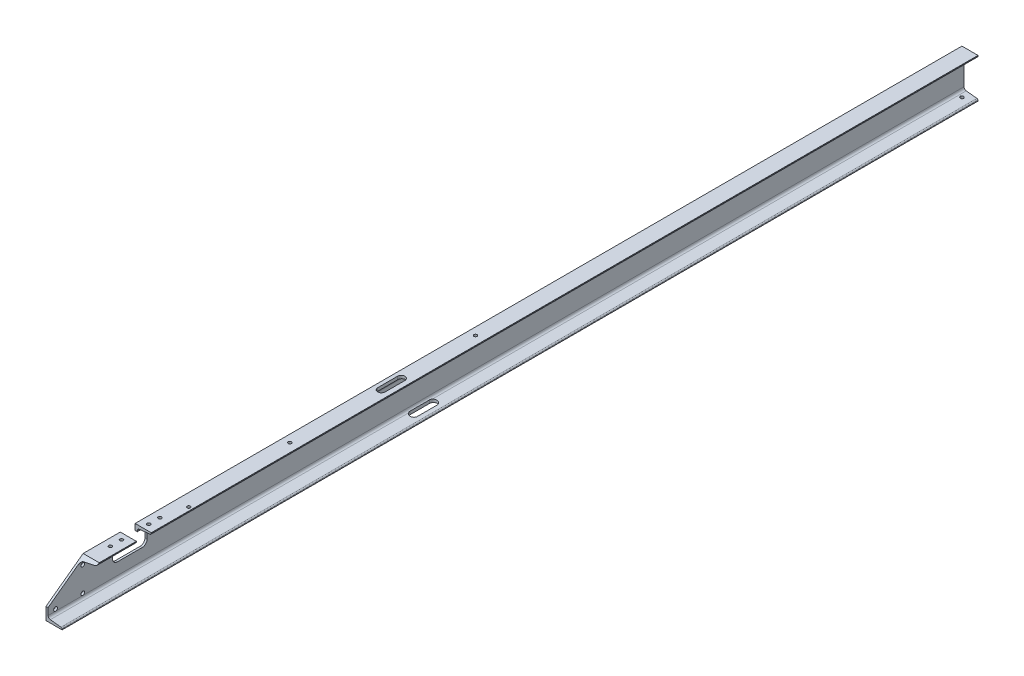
from build123d import *

# Parameters (mm, degrees)
EXTRUDE_1_DEPTH        = 1850
SKETCH_2_R             = 7.5
SKETCH_2_R_2           = 6.5
CUT_EXTRUDE_1_DEPTH    = 3700
SKETCH_3_R             = 6.5
CUT_EXTRUDE_2_DEPTH    = 3700
PATTERN_LINEAR_1_COUNT = 10
PATTERN_LINEAR_1_PITCH = 200
SKETCH_4_R             = 6.5
CUT_EXTRUDE_3_DEPTH    = 20
SKETCH_5_R             = 6.5
CUT_EXTRUDE_4_DEPTH    = 10
CUT_EXTRUDE_5_DEPTH    = 15
CUT_EXTRUDE_START      = -30
CUT_EXTRUDE_6_DEPTH    = 1829.043325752
SKETCH_8_R             = 6.5
CUT_EXTRUDE_7_DEPTH    = 20


with BuildPart() as part:
    # Sketch 1 → Extrude 1 (new, symmetric)
    with BuildSketch(Plane.XY):
        with BuildLine():
            Line((0, 80), (0, -80))
            Line((0, -80), (65, -80))
            Line((65, -80), (65, -77.497140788))
            ThreePointArc((65, -77.497140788), (63.717527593, -74.153491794), (60.528004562, -72.52509783))
            Line((60.528004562, -72.52509783), (17.443990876, -67.949804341))
            ThreePointArc((17.443990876, -67.949804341), (11.064944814, -64.693016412), (8.5, -58.005718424))
            Line((8.5, -58.005718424), (8.5, 58.005718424))
            ThreePointArc((8.5, 58.005718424), (11.064944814, 64.693016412), (17.443990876, 67.949804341))
            Line((17.443990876, 67.949804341), (60.528004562, 72.52509783))
            ThreePointArc((60.528004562, 72.52509783), (63.717527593, 74.153491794), (65, 77.497140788))
            Line((65, 77.497140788), (65, 80))
            Line((65, 80), (0, 80))
        make_face()
    extrude(amount=EXTRUDE_1_DEPTH, both=True)

    # Sketch 2 → Cut-Extrude 1 (cut)
    with BuildSketch(Plane.ZY):
        with Locations(Location((1820, -50, 0), (0, 0, 270))):
            Circle(SKETCH_2_R)
        with Locations(Location((1710, -50, 0), (0, 0, 270))):
            Circle(SKETCH_2_R)
        with Locations(Location((1417, 40, 0), (0, 0, 270))):
            Circle(SKETCH_2_R_2)
        with Locations(Location((1617, 40, 0), (0, 0, 270))):
            Circle(SKETCH_2_R_2)
        with Locations(Location((1710, 50, 0), (0, 0, 270))):
            Circle(SKETCH_2_R)
        Polygon((1700, 80), (1850, 80), (1850, -30), align=None)
        with BuildLine():
            Line((1490, 80), (1490, 55))
            Line((1490, 55), (1470, 55))
            ThreePointArc((1470, 55), (1455.857864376, 49.142135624), (1450, 35))
            Line((1450, 35), (1450, 10))
            ThreePointArc((1450, 10), (1455.857864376, -4.142135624), (1470, -10))
            Line((1470, -10), (1570, -10))
            ThreePointArc((1570, -10), (1584.142135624, -4.142135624), (1590, 10))
            Line((1590, 10), (1590, 35))
            ThreePointArc((1590, 35), (1584.142135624, 49.142135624), (1570, 55))
            Line((1570, 55), (1550, 55))
            Line((1550, 55), (1550, 80))
            Line((1550, 80), (1490, 80))
        make_face()
    extrude(amount=-CUT_EXTRUDE_1_DEPTH, mode=Mode.SUBTRACT)

    # Sketch 3 → Cut-Extrude 2 (cut)
    with BuildSketch(Plane.ZY):
        with Locations(Location((920, 29, 0), (0, 0, 270))):
            Circle(SKETCH_3_R)
    cut_extrude_2 = extrude(amount=-CUT_EXTRUDE_2_DEPTH, mode=Mode.SUBTRACT)

    # Pattern Linear 1: Cut-Extrude 2 ×10
    with Locations(*[(0, 0, -i * PATTERN_LINEAR_1_PITCH) for i in range(1, PATTERN_LINEAR_1_COUNT)]):
        add(cut_extrude_2, mode=Mode.SUBTRACT)

    # Sketch 4 → Cut-Extrude 3 (cut)
    with BuildSketch(Plane(origin=(0, 80, 0), x_dir=(-1, 0, 0), z_dir=(0, 1, 0))):
        with Locations((-30, 1620)):
            Circle(SKETCH_4_R)
        with Locations((-30, 1575)):
            Circle(SKETCH_4_R)
        with Locations((-30, 1465)):
            Circle(SKETCH_4_R)
        with Locations((-30, 1420)):
            Circle(SKETCH_4_R)
        with Locations((-30, 895)):
            Circle(SKETCH_4_R)
        with Locations((-30, 145)):
            Circle(SKETCH_4_R)
    extrude(amount=-CUT_EXTRUDE_3_DEPTH, mode=Mode.SUBTRACT)

    # Sketch 5 → Cut-Extrude 4 (cut)
    with BuildSketch(Plane(origin=(0, 80, 0), x_dir=(-1, 0, 0), z_dir=(0, 1, 0))):
        with Locations((-51, 1324)):
            Circle(SKETCH_5_R)
    extrude(amount=-CUT_EXTRUDE_4_DEPTH, mode=Mode.SUBTRACT)

    # Sketch 6 → Cut-Extrude 5 (cut)
    with BuildSketch(Plane(origin=(0, 80, 0), x_dir=(-1, 0, 0), z_dir=(0, 1, 0))):
        with BuildLine():
            Line((-45, 525), (-45, 445))
            ThreePointArc((-45, 445), (-30, 430), (-15, 445))
            Line((-15, 445), (-15, 525))
            ThreePointArc((-15, 525), (-30, 540), (-45, 525))
        make_face()
    extrude(amount=-CUT_EXTRUDE_5_DEPTH, mode=Mode.SUBTRACT)

    # Sketch 7 → Cut-Extrude 6 (cut, through all)
    with BuildSketch(Plane(origin=(0, 80, 0), x_dir=(-1, 0, 0), z_dir=(0, 1, 0)).offset(CUT_EXTRUDE_START)):
        with BuildLine():
            Line((-45, 395), (-45, 315))
            ThreePointArc((-45, 315), (-30, 300), (-15, 315))
            Line((-15, 315), (-15, 395))
            ThreePointArc((-15, 395), (-30, 410), (-45, 395))
        make_face()
    extrude(amount=-CUT_EXTRUDE_6_DEPTH, mode=Mode.SUBTRACT)

    # Sketch 8 → Cut-Extrude 7 (cut)
    with BuildSketch(Plane.XZ.offset(80)):
        with Locations(Location((30, -1820, 0), (0, 0, 270))):
            Circle(SKETCH_8_R)
    extrude(amount=-CUT_EXTRUDE_7_DEPTH, mode=Mode.SUBTRACT)


solid = part.part
